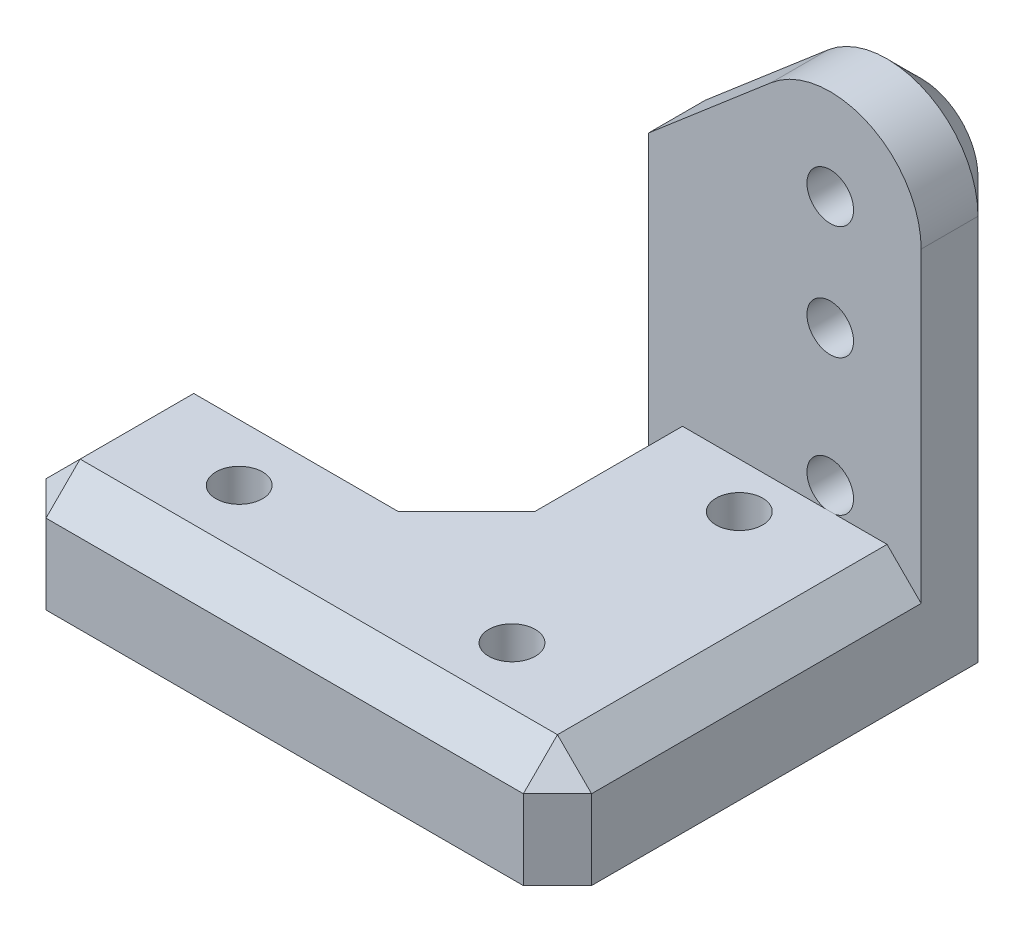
from build123d import *

# Parameters (mm, degrees)
RESSALTO_EXTRUS_O1_DEPTH                      = 20
ESBO_O2_W                                     = 16
ESBO_O2_H                                     = 16
CORTE_EXTRUS_O1_DEPTH                         = 34.120990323
FURO_ROSCADO_DE_M2_51_D                       = 2.05
FURO_ROSCADO_DE_M2_51_DEPTH                   = 7.25
FURO_ROSCADO_DE_M2_51_TIP                     = 0.615882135
CORTE_EXTRUS_O2_DEPTH                         = 34.120990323
ESBO_O9_W                                     = 8
ESBO_O9_H                                     = 5
RESSALTO_EXTRUS_O2_DEPTH                      = 12
CHANFRO1_SIZE                                 = 1.5
CHANFRO2_SIZE                                 = 1.5
FURO_ROSCADO_DE_M2_52_D                       = 2.05
FURO_ROSCADO_DE_M2_52_DEPTH                   = 7.25
FURO_ROSCADO_DE_M2_52_TIP                     = 0.615882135
BROCA_DE_ROSQUEAR_PARA_TARRAXA_DE_M2_51_D     = 2.05
BROCA_DE_ROSQUEAR_PARA_TARRAXA_DE_M2_51_DEPTH = 4


with BuildPart() as part:
    # Esbo_o1 → Ressalto-extrus_o1 (new body)
    with BuildSketch(Plane.XY):
        with BuildLine():
            Line((0, 0), (0, 12))
            Line((0, 12), (9.400080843, 20.039805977))
            ThreePointArc((9.400080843, 20.039805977), (13.673368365, 20.633158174), (16, 17))
            Line((16, 17), (16, 4))
            Line((16, 4), (16, 0))
            Line((16, 0), (0, 0))
        make_face()
    extrude(amount=RESSALTO_EXTRUS_O1_DEPTH)

    # Esbo_o2 → Corte-extrus_o1 (cut, through all)
    with BuildSketch(Plane.ZY):
        with Locations((12, 13)):
            Rectangle(ESBO_O2_W, ESBO_O2_H)
    extrude(amount=-CORTE_EXTRUS_O1_DEPTH, mode=Mode.SUBTRACT)

    # Furo roscado de M2.51
    with Locations(Plane(origin=(12, 17, 4), x_dir=(1, 0, 0), z_dir=(0, 0, 1))):
        with Locations((0, 0)):
            Hole(FURO_ROSCADO_DE_M2_51_D / 2, depth=FURO_ROSCADO_DE_M2_51_DEPTH)
            with Locations((0, 0, -(FURO_ROSCADO_DE_M2_51_DEPTH + FURO_ROSCADO_DE_M2_51_TIP / 2))):  # 118° drill point
                Cone(0, FURO_ROSCADO_DE_M2_51_D / 2, FURO_ROSCADO_DE_M2_51_TIP, mode=Mode.SUBTRACT)

    # Esbo_o6 → Corte-extrus_o2 (cut, through all)
    with BuildSketch(Plane.XY.offset(20)):
        Polygon((0, 0), (4, 0), (4, 15.42116461), (0, 12), align=None)
    extrude(amount=-CORTE_EXTRUS_O2_DEPTH, mode=Mode.SUBTRACT)

    # Esbo_o9 → Ressalto-extrus_o2 (add)
    with BuildSketch(Plane.ZY.offset(-4)):
        with Locations((16, 2.5)):
            Rectangle(ESBO_O9_W, ESBO_O9_H)
    extrude(amount=RESSALTO_EXTRUS_O2_DEPTH)

    # Chanfro1
    chanfro1_edges = [part.edges().sort_by_distance(p)[0] for p in [
        (4, 7.710582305, 0),
        (6.700040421, 17.730485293, 0),
        (13.673368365, 20.633158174, 0),
        (16, 8.5, 0),
    ]]
    chamfer(chanfro1_edges, length=CHANFRO1_SIZE)

    # Chanfro2
    chanfro2_edges = [part.edges().sort_by_distance(p)[0] for p in [
        (16, 5, 12),
        (4, 5, 20),
        (4, 5, 8),
        (4, 2.5, 12),
        (-2, 5, 12),
        (-8, 2.5, 20),
        (-8, 5, 16),
        (-8, 2.5, 12),
        (16, 2.5, 20),
    ]]
    chamfer(chanfro2_edges, length=CHANFRO2_SIZE)

    # Furo roscado de M2.52
    with Locations(Plane(origin=(10, 0, 6), x_dir=(0, 0, -1), z_dir=(0, -1, 0))):
        with Locations((0, 0), (-10, 0), (-10, -12)):
            Hole(FURO_ROSCADO_DE_M2_52_D / 2, depth=FURO_ROSCADO_DE_M2_52_DEPTH)
            with Locations((0, 0, -(FURO_ROSCADO_DE_M2_52_DEPTH + FURO_ROSCADO_DE_M2_52_TIP / 2))):  # 118° drill point
                Cone(0, FURO_ROSCADO_DE_M2_52_D / 2, FURO_ROSCADO_DE_M2_52_TIP, mode=Mode.SUBTRACT)

    # Broca de rosquear para tarraxa de M2.51
    with Locations(Plane(origin=(12, 6, 0), x_dir=(-1, 0, 0), z_dir=(0, 0, -1))):
        with Locations((0, 0), (0, 6)):
            Hole(BROCA_DE_ROSQUEAR_PARA_TARRAXA_DE_M2_51_D / 2, depth=BROCA_DE_ROSQUEAR_PARA_TARRAXA_DE_M2_51_DEPTH)


solid = part.part
